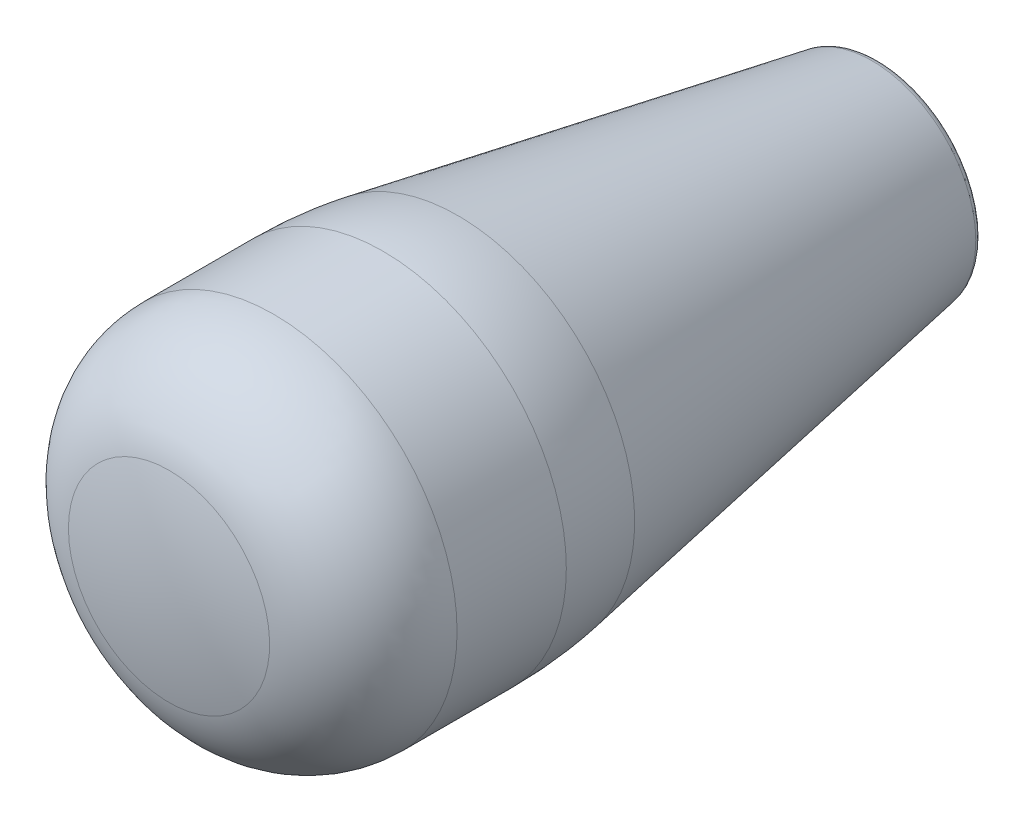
ISO-10303-21;
HEADER;
FILE_DESCRIPTION(('STEP AP214'),'2;1');
FILE_NAME('part.step','',(''),(''),'','','');
FILE_SCHEMA(('AUTOMOTIVE_DESIGN { 1 0 10303 214 1 1 1 1 }'));
ENDSEC;
DATA;
#1=APPLICATION_CONTEXT('core data for automotive mechanical design processes');
#2=APPLICATION_PROTOCOL_DEFINITION('international standard','automotive_design',2000,#1);
#3=PRODUCT_CONTEXT('',#1,'mechanical');
#4=PRODUCT('Part','Part','',(#3));
#5=PRODUCT_RELATED_PRODUCT_CATEGORY('part','',(#4));
#6=PRODUCT_DEFINITION_FORMATION('','',#4);
#7=PRODUCT_DEFINITION_CONTEXT('part definition',#1,'design');
#8=PRODUCT_DEFINITION('design','',#6,#7);
#9=PRODUCT_DEFINITION_SHAPE('','',#8);
#10=(LENGTH_UNIT() NAMED_UNIT(*) SI_UNIT(.MILLI.,.METRE.));
#11=(NAMED_UNIT(*) PLANE_ANGLE_UNIT() SI_UNIT($,.RADIAN.));
#12=(NAMED_UNIT(*) SI_UNIT($,.STERADIAN.) SOLID_ANGLE_UNIT());
#13=UNCERTAINTY_MEASURE_WITH_UNIT(LENGTH_MEASURE(1.E-05),#10,'distance_accuracy_value','');
#14=(GEOMETRIC_REPRESENTATION_CONTEXT(3) GLOBAL_UNCERTAINTY_ASSIGNED_CONTEXT((#13)) GLOBAL_UNIT_ASSIGNED_CONTEXT((#10,
#11,#12)) REPRESENTATION_CONTEXT('',''));
#15=CARTESIAN_POINT('',(0.,0.,0.));
#16=DIRECTION('',(0.,0.,1.));
#17=DIRECTION('',(1.,0.,0.));
#18=AXIS2_PLACEMENT_3D('',#15,#16,#17);
#19=CARTESIAN_POINT('',(0.,0.,8.));
#20=DIRECTION('',(0.,0.,1.));
#21=DIRECTION('',(1.,0.,0.));
#22=AXIS2_PLACEMENT_3D('',#19,#20,#21);
#23=PLANE('',#22);
#24=CARTESIAN_POINT('',(0.,0.,8.));
#25=DIRECTION('',(0.,0.,1.));
#26=DIRECTION('',(1.,0.,0.));
#27=AXIS2_PLACEMENT_3D('',#24,#25,#26);
#28=CIRCLE('',#27,5.25);
#29=CARTESIAN_POINT('',(5.25,0.,8.));
#30=VERTEX_POINT('',#29);
#31=EDGE_CURVE('E38',#30,#30,#28,.T.);
#32=ORIENTED_EDGE('',*,*,#31,.F.);
#33=EDGE_LOOP('',(#32));
#34=FACE_BOUND('',#33,.T.);
#35=CARTESIAN_POINT('',(0.,0.,8.));
#36=DIRECTION('',(0.,0.,1.));
#37=DIRECTION('',(1.,0.,0.));
#38=AXIS2_PLACEMENT_3D('',#35,#36,#37);
#39=CIRCLE('',#38,5.);
#40=CARTESIAN_POINT('',(5.,0.,8.));
#41=VERTEX_POINT('',#40);
#42=EDGE_CURVE('E47',#41,#41,#39,.T.);
#43=ORIENTED_EDGE('',*,*,#42,.T.);
#44=EDGE_LOOP('',(#43));
#45=FACE_BOUND('',#44,.T.);
#46=ADVANCED_FACE('F12',(#34,#45),#23,.F.);
#47=CARTESIAN_POINT('',(0.,0.,0.));
#48=DIRECTION('',(0.,0.,-1.));
#49=DIRECTION('',(-1.,0.,0.));
#50=AXIS2_PLACEMENT_3D('',#47,#48,#49);
#51=PLANE('',#50);
#52=CARTESIAN_POINT('',(0.,0.,0.));
#53=DIRECTION('',(0.,0.,-1.));
#54=DIRECTION('',(-1.,0.,0.));
#55=AXIS2_PLACEMENT_3D('',#52,#53,#54);
#56=CIRCLE('',#55,8.82872029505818);
#57=CARTESIAN_POINT('',(-8.82872029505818,0.,0.));
#58=VERTEX_POINT('',#57);
#59=EDGE_CURVE('E27',#58,#58,#56,.T.);
#60=ORIENTED_EDGE('',*,*,#59,.T.);
#61=EDGE_LOOP('',(#60));
#62=FACE_BOUND('',#61,.T.);
#63=CARTESIAN_POINT('',(0.,0.,0.));
#64=DIRECTION('',(0.,0.,1.));
#65=DIRECTION('',(1.,0.,0.));
#66=AXIS2_PLACEMENT_3D('',#63,#64,#65);
#67=CIRCLE('',#66,5.25);
#68=CARTESIAN_POINT('',(5.25,0.,0.));
#69=VERTEX_POINT('',#68);
#70=EDGE_CURVE('E41',#69,#69,#67,.T.);
#71=ORIENTED_EDGE('',*,*,#70,.T.);
#72=EDGE_LOOP('',(#71));
#73=FACE_BOUND('',#72,.T.);
#74=ADVANCED_FACE('F72',(#62,#73),#51,.T.);
#75=CARTESIAN_POINT('',(0.,0.,56.1719042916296));
#76=DIRECTION('',(0.,0.,-1.));
#77=DIRECTION('',(-1.,0.,0.));
#78=AXIS2_PLACEMENT_3D('',#75,#76,#77);
#79=DEGENERATE_TOROIDAL_SURFACE('',#78,7.,10.,.T.);
#80=CARTESIAN_POINT('',(0.,0.,65.8958723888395));
#81=DIRECTION('',(0.,0.,-1.));
#82=DIRECTION('',(-1.,0.,0.));
#83=AXIS2_PLACEMENT_3D('',#80,#81,#82);
#84=CIRCLE('',#83,9.33333333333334);
#85=CARTESIAN_POINT('',(-9.33333333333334,0.,65.8958723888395));
#86=VERTEX_POINT('',#85);
#87=EDGE_CURVE('E32',#86,#86,#84,.T.);
#88=ORIENTED_EDGE('',*,*,#87,.T.);
#89=EDGE_LOOP('',(#88));
#90=FACE_BOUND('',#89,.T.);
#91=CARTESIAN_POINT('',(0.,0.,56.1719042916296));
#92=DIRECTION('',(0.,0.,-1.));
#93=DIRECTION('',(-1.,0.,0.));
#94=AXIS2_PLACEMENT_3D('',#91,#92,#93);
#95=CIRCLE('',#94,17.);
#96=CARTESIAN_POINT('',(-17.,0.,56.1719042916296));
#97=VERTEX_POINT('',#96);
#98=EDGE_CURVE('E35',#97,#97,#95,.T.);
#99=ORIENTED_EDGE('',*,*,#98,.F.);
#100=EDGE_LOOP('',(#99));
#101=FACE_BOUND('',#100,.T.);
#102=ADVANCED_FACE('F78',(#90,#101),#79,.T.);
#103=CARTESIAN_POINT('',(0.,0.,27.));
#104=DIRECTION('',(0.,0.,-1.));
#105=DIRECTION('',(0.,1.,0.));
#106=AXIS2_PLACEMENT_3D('',#103,#104,#105);
#107=SPHERICAL_SURFACE('',#106,40.);
#108=ORIENTED_EDGE('',*,*,#87,.F.);
#109=EDGE_LOOP('',(#108));
#110=FACE_BOUND('',#109,.T.);
#111=ADVANCED_FACE('F87',(#110),#107,.T.);
#112=CARTESIAN_POINT('',(0.,0.,0.));
#113=DIRECTION('',(0.,0.,1.));
#114=DIRECTION('',(1.,0.,0.));
#115=AXIS2_PLACEMENT_3D('',#112,#113,#114);
#116=CONICAL_SURFACE('',#115,9.5,0.174532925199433);
#117=CARTESIAN_POINT('',(0.,0.,39.0882330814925));
#118=DIRECTION('',(0.,0.,-1.));
#119=DIRECTION('',(-1.,0.,0.));
#120=AXIS2_PLACEMENT_3D('',#117,#118,#119);
#121=CIRCLE('',#120,16.3923101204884);
#122=CARTESIAN_POINT('',(-16.3923101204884,0.,39.0882330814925));
#123=VERTEX_POINT('',#122);
#124=EDGE_CURVE('E19',#123,#123,#121,.T.);
#125=ORIENTED_EDGE('',*,*,#124,.T.);
#126=EDGE_LOOP('',(#125));
#127=FACE_BOUND('',#126,.T.);
#128=CARTESIAN_POINT('',(0.,0.,0.661081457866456));
#129=DIRECTION('',(0.,0.,-1.));
#130=DIRECTION('',(-1.,0.,0.));
#131=AXIS2_PLACEMENT_3D('',#128,#129,#130);
#132=CIRCLE('',#131,9.61656649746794);
#133=CARTESIAN_POINT('',(-9.61656649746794,0.,0.661081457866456));
#134=VERTEX_POINT('',#133);
#135=EDGE_CURVE('E23',#134,#134,#132,.F.);
#136=ORIENTED_EDGE('',*,*,#135,.T.);
#137=EDGE_LOOP('',(#136));
#138=FACE_BOUND('',#137,.T.);
#139=ADVANCED_FACE('F85',(#127,#138),#116,.T.);
#140=CARTESIAN_POINT('',(0.,0.,0.));
#141=DIRECTION('',(0.,0.,-1.));
#142=DIRECTION('',(-1.,0.,0.));
#143=AXIS2_PLACEMENT_3D('',#140,#141,#142);
#144=CYLINDRICAL_SURFACE('',#143,17.);
#145=CARTESIAN_POINT('',(0.,0.,46.0341601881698));
#146=DIRECTION('',(0.,0.,1.));
#147=DIRECTION('',(1.,0.,0.));
#148=AXIS2_PLACEMENT_3D('',#145,#146,#147);
#149=CIRCLE('',#148,17.);
#150=CARTESIAN_POINT('',(17.,0.,46.0341601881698));
#151=VERTEX_POINT('',#150);
#152=EDGE_CURVE('E8',#151,#151,#149,.T.);
#153=ORIENTED_EDGE('',*,*,#152,.T.);
#154=EDGE_LOOP('',(#153));
#155=FACE_BOUND('',#154,.T.);
#156=ORIENTED_EDGE('',*,*,#98,.T.);
#157=EDGE_LOOP('',(#156));
#158=FACE_BOUND('',#157,.T.);
#159=ADVANCED_FACE('F67',(#155,#158),#144,.T.);
#160=CARTESIAN_POINT('',(0.,0.,8.));
#161=DIRECTION('',(0.,0.,-1.));
#162=DIRECTION('',(-1.,0.,0.));
#163=AXIS2_PLACEMENT_3D('',#160,#161,#162);
#164=CYLINDRICAL_SURFACE('',#163,5.25);
#165=ORIENTED_EDGE('',*,*,#31,.T.);
#166=EDGE_LOOP('',(#165));
#167=FACE_BOUND('',#166,.T.);
#168=ORIENTED_EDGE('',*,*,#70,.F.);
#169=EDGE_LOOP('',(#168));
#170=FACE_BOUND('',#169,.T.);
#171=ADVANCED_FACE('F55',(#167,#170),#164,.F.);
#172=CARTESIAN_POINT('',(0.,0.,40.));
#173=DIRECTION('',(0.,0.,-1.));
#174=DIRECTION('',(-1.,0.,0.));
#175=AXIS2_PLACEMENT_3D('',#172,#173,#174);
#176=CYLINDRICAL_SURFACE('',#175,5.);
#177=CARTESIAN_POINT('',(0.,0.,40.));
#178=DIRECTION('',(0.,0.,1.));
#179=DIRECTION('',(1.,0.,0.));
#180=AXIS2_PLACEMENT_3D('',#177,#178,#179);
#181=CIRCLE('',#180,5.);
#182=CARTESIAN_POINT('',(5.,0.,40.));
#183=VERTEX_POINT('',#182);
#184=EDGE_CURVE('E44',#183,#183,#181,.T.);
#185=ORIENTED_EDGE('',*,*,#184,.T.);
#186=EDGE_LOOP('',(#185));
#187=FACE_BOUND('',#186,.T.);
#188=ORIENTED_EDGE('',*,*,#42,.F.);
#189=EDGE_LOOP('',(#188));
#190=FACE_BOUND('',#189,.T.);
#191=ADVANCED_FACE('F52',(#187,#190),#176,.F.);
#192=CARTESIAN_POINT('',(0.,0.,40.));
#193=DIRECTION('',(0.,0.,1.));
#194=DIRECTION('',(1.,0.,0.));
#195=AXIS2_PLACEMENT_3D('',#192,#193,#194);
#196=PLANE('',#195);
#197=ORIENTED_EDGE('',*,*,#184,.F.);
#198=EDGE_LOOP('',(#197));
#199=FACE_BOUND('',#198,.T.);
#200=ADVANCED_FACE('F54',(#199),#196,.F.);
#201=CARTESIAN_POINT('',(0.,0.,0.8));
#202=DIRECTION('',(0.,0.,-1.));
#203=DIRECTION('',(-1.,0.,0.));
#204=AXIS2_PLACEMENT_3D('',#201,#202,#203);
#205=TOROIDAL_SURFACE('',#204,8.82872029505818,0.8);
#206=ORIENTED_EDGE('',*,*,#135,.F.);
#207=EDGE_LOOP('',(#206));
#208=FACE_BOUND('',#207,.T.);
#209=ORIENTED_EDGE('',*,*,#59,.F.);
#210=EDGE_LOOP('',(#209));
#211=FACE_BOUND('',#210,.T.);
#212=ADVANCED_FACE('F64',(#208,#211),#205,.T.);
#213=CARTESIAN_POINT('',(0.,0.,46.0341601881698));
#214=DIRECTION('',(0.,0.,1.));
#215=DIRECTION('',(1.,0.,0.));
#216=AXIS2_PLACEMENT_3D('',#213,#214,#215);
#217=DEGENERATE_TOROIDAL_SURFACE('',#216,23.,40.,.F.);
#218=ORIENTED_EDGE('',*,*,#152,.F.);
#219=EDGE_LOOP('',(#218));
#220=FACE_BOUND('',#219,.T.);
#221=ORIENTED_EDGE('',*,*,#124,.F.);
#222=EDGE_LOOP('',(#221));
#223=FACE_BOUND('',#222,.T.);
#224=ADVANCED_FACE('F14',(#220,#223),#217,.F.);
#225=CLOSED_SHELL('',(#46,#74,#102,#111,#139,#159,#171,#191,#200,#212,#224));
#226=MANIFOLD_SOLID_BREP('B1',#225);
#227=ADVANCED_BREP_SHAPE_REPRESENTATION('',(#18,#226),#14);
#228=SHAPE_DEFINITION_REPRESENTATION(#9,#227);
ENDSEC;
END-ISO-10303-21;
